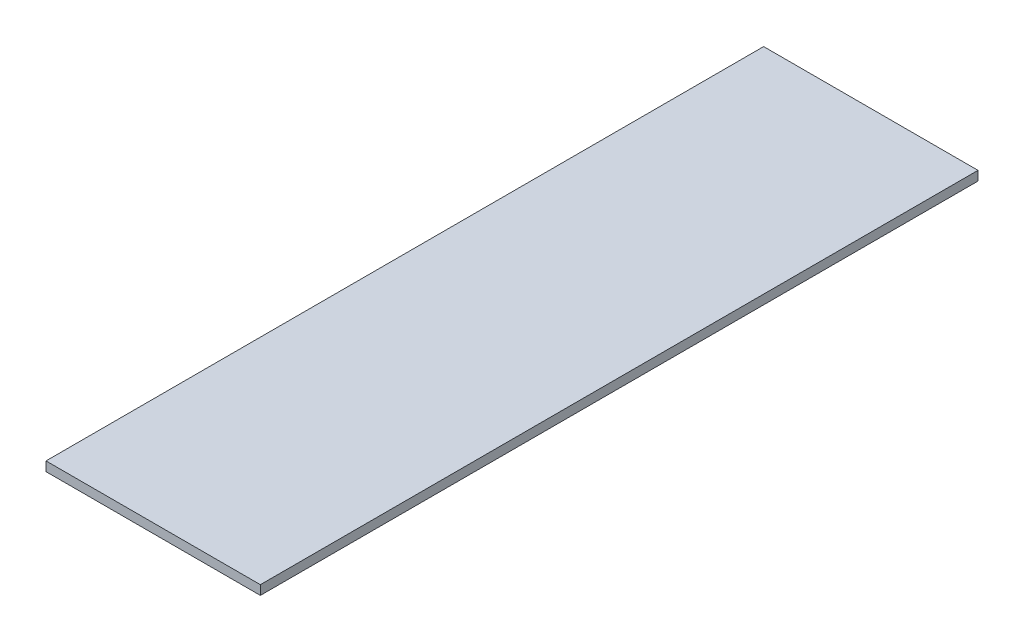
from build123d import *

# Parameters (mm, degrees)
SKETCH1_W           = 292.1
SKETCH1_H           = 977.9
BOSS_EXTRUDE1_DEPTH = 12.7


with BuildPart() as part:
    # Sketch1 → Boss-Extrude1 (new body)
    with BuildSketch(Plane(origin=(0, 0, 0), x_dir=(1, 0, 0), z_dir=(0, 1, 0))):
        with Locations((-146.05, -488.95)):
            Rectangle(SKETCH1_W, SKETCH1_H)
    extrude(amount=BOSS_EXTRUDE1_DEPTH)


solid = part.part
